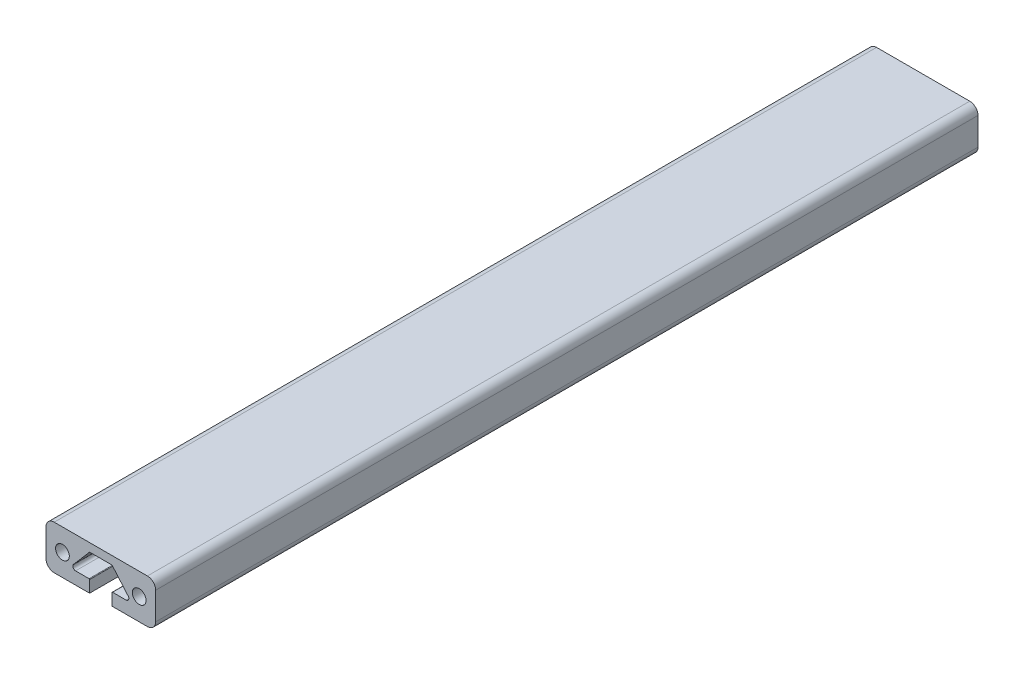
ISO-10303-21;
HEADER;
FILE_DESCRIPTION(('STEP AP214'),'2;1');
FILE_NAME('part.step','',(''),(''),'','','');
FILE_SCHEMA(('AUTOMOTIVE_DESIGN { 1 0 10303 214 1 1 1 1 }'));
ENDSEC;
DATA;
#1=APPLICATION_CONTEXT('core data for automotive mechanical design processes');
#2=APPLICATION_PROTOCOL_DEFINITION('international standard','automotive_design',2000,#1);
#3=PRODUCT_CONTEXT('',#1,'mechanical');
#4=PRODUCT('Part','Part','',(#3));
#5=PRODUCT_RELATED_PRODUCT_CATEGORY('part','',(#4));
#6=PRODUCT_DEFINITION_FORMATION('','',#4);
#7=PRODUCT_DEFINITION_CONTEXT('part definition',#1,'design');
#8=PRODUCT_DEFINITION('design','',#6,#7);
#9=PRODUCT_DEFINITION_SHAPE('','',#8);
#10=(LENGTH_UNIT() NAMED_UNIT(*) SI_UNIT(.MILLI.,.METRE.));
#11=(NAMED_UNIT(*) PLANE_ANGLE_UNIT() SI_UNIT($,.RADIAN.));
#12=(NAMED_UNIT(*) SI_UNIT($,.STERADIAN.) SOLID_ANGLE_UNIT());
#13=UNCERTAINTY_MEASURE_WITH_UNIT(LENGTH_MEASURE(1.E-05),#10,'distance_accuracy_value','');
#14=(GEOMETRIC_REPRESENTATION_CONTEXT(3) GLOBAL_UNCERTAINTY_ASSIGNED_CONTEXT((#13)) GLOBAL_UNIT_ASSIGNED_CONTEXT((#10,
#11,#12)) REPRESENTATION_CONTEXT('',''));
#15=CARTESIAN_POINT('',(0.,0.,0.));
#16=DIRECTION('',(0.,0.,1.));
#17=DIRECTION('',(1.,0.,0.));
#18=AXIS2_PLACEMENT_3D('',#15,#16,#17);
#19=CARTESIAN_POINT('',(-17.,-5.,150.));
#20=DIRECTION('',(0.,0.,1.));
#21=DIRECTION('',(1.,0.,0.));
#22=AXIS2_PLACEMENT_3D('',#19,#20,#21);
#23=PLANE('',#22);
#24=CARTESIAN_POINT('',(-14.,0.,150.));
#25=DIRECTION('',(0.,0.,1.));
#26=DIRECTION('',(1.,0.,0.));
#27=AXIS2_PLACEMENT_3D('',#24,#25,#26);
#28=CIRCLE('',#27,2.5);
#29=CARTESIAN_POINT('',(-11.5,0.,150.));
#30=VERTEX_POINT('',#29);
#31=EDGE_CURVE('E219',#30,#30,#28,.T.);
#32=ORIENTED_EDGE('',*,*,#31,.F.);
#33=EDGE_LOOP('',(#32));
#34=FACE_BOUND('',#33,.T.);
#35=CARTESIAN_POINT('',(-17.,-5.,150.));
#36=DIRECTION('',(0.,0.,1.));
#37=DIRECTION('',(1.,0.,0.));
#38=AXIS2_PLACEMENT_3D('',#35,#36,#37);
#39=CIRCLE('',#38,3.);
#40=CARTESIAN_POINT('',(-20.,-5.,150.));
#41=VERTEX_POINT('',#40);
#42=CARTESIAN_POINT('',(-17.,-8.,150.));
#43=VERTEX_POINT('',#42);
#44=EDGE_CURVE('E274',#41,#43,#39,.T.);
#45=ORIENTED_EDGE('',*,*,#44,.T.);
#46=DIRECTION('',(1.,0.,0.));
#47=VECTOR('',#46,1.);
#48=CARTESIAN_POINT('',(-17.,-8.,150.));
#49=LINE('',#48,#47);
#50=CARTESIAN_POINT('',(-4.098545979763,-8.,150.));
#51=VERTEX_POINT('',#50);
#52=EDGE_CURVE('E136',#43,#51,#49,.T.);
#53=ORIENTED_EDGE('',*,*,#52,.T.);
#54=DIRECTION('',(0.,1.,0.));
#55=VECTOR('',#54,1.);
#56=CARTESIAN_POINT('',(-4.098545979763,-8.,150.));
#57=LINE('',#56,#55);
#58=CARTESIAN_POINT('',(-4.098545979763,-3.70000000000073,150.));
#59=VERTEX_POINT('',#58);
#60=EDGE_CURVE('E342',#51,#59,#57,.T.);
#61=ORIENTED_EDGE('',*,*,#60,.T.);
#62=CARTESIAN_POINT('',(-4.29854597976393,-3.70000000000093,150.));
#63=DIRECTION('',(0.,0.,1.));
#64=DIRECTION('',(1.,0.,0.));
#65=AXIS2_PLACEMENT_3D('',#62,#63,#64);
#66=CIRCLE('',#65,0.200000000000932);
#67=CARTESIAN_POINT('',(-4.29854597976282,-3.5,150.));
#68=VERTEX_POINT('',#67);
#69=EDGE_CURVE('E362',#59,#68,#66,.T.);
#70=ORIENTED_EDGE('',*,*,#69,.T.);
#71=DIRECTION('',(-1.,0.,0.));
#72=VECTOR('',#71,1.);
#73=CARTESIAN_POINT('',(-4.29854597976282,-3.5,150.));
#74=LINE('',#73,#72);
#75=CARTESIAN_POINT('',(-9.21858593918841,-3.5,150.));
#76=VERTEX_POINT('',#75);
#77=EDGE_CURVE('E358',#68,#76,#74,.T.);
#78=ORIENTED_EDGE('',*,*,#77,.T.);
#79=CARTESIAN_POINT('',(-9.21858593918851,-2.50000000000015,150.));
#80=DIRECTION('',(0.,0.,-1.));
#81=DIRECTION('',(1.,0.,0.));
#82=AXIS2_PLACEMENT_3D('',#79,#80,#81);
#83=CIRCLE('',#82,0.999999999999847);
#84=CARTESIAN_POINT('',(-9.97737449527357,-1.84866296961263,150.));
#85=VERTEX_POINT('',#84);
#86=EDGE_CURVE('E361',#76,#85,#83,.T.);
#87=ORIENTED_EDGE('',*,*,#86,.T.);
#88=DIRECTION('',(0.651337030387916,0.758788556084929,0.));
#89=VECTOR('',#88,1.);
#90=CARTESIAN_POINT('',(-9.97737449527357,-1.84866296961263,150.));
#91=LINE('',#90,#89);
#92=CARTESIAN_POINT('',(-4.098545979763,5.,150.));
#93=VERTEX_POINT('',#92);
#94=EDGE_CURVE('E366',#85,#93,#91,.T.);
#95=ORIENTED_EDGE('',*,*,#94,.T.);
#96=DIRECTION('',(1.,0.,0.));
#97=VECTOR('',#96,1.);
#98=CARTESIAN_POINT('',(-4.098545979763,5.,150.));
#99=LINE('',#98,#97);
#100=CARTESIAN_POINT('',(4.09854597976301,5.,150.));
#101=VERTEX_POINT('',#100);
#102=EDGE_CURVE('E374',#93,#101,#99,.T.);
#103=ORIENTED_EDGE('',*,*,#102,.T.);
#104=DIRECTION('',(0.651337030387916,-0.758788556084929,0.));
#105=VECTOR('',#104,1.);
#106=CARTESIAN_POINT('',(4.09854597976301,5.,150.));
#107=LINE('',#106,#105);
#108=CARTESIAN_POINT('',(9.97737449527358,-1.84866296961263,150.));
#109=VERTEX_POINT('',#108);
#110=EDGE_CURVE('E377',#101,#109,#107,.T.);
#111=ORIENTED_EDGE('',*,*,#110,.T.);
#112=CARTESIAN_POINT('',(9.21858593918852,-2.50000000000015,150.));
#113=DIRECTION('',(0.,0.,-1.));
#114=DIRECTION('',(1.,0.,0.));
#115=AXIS2_PLACEMENT_3D('',#112,#113,#114);
#116=CIRCLE('',#115,0.999999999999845);
#117=CARTESIAN_POINT('',(9.21858593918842,-3.5,150.));
#118=VERTEX_POINT('',#117);
#119=EDGE_CURVE('E380',#109,#118,#116,.T.);
#120=ORIENTED_EDGE('',*,*,#119,.T.);
#121=DIRECTION('',(-1.,0.,0.));
#122=VECTOR('',#121,1.);
#123=CARTESIAN_POINT('',(9.21858593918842,-3.5,150.));
#124=LINE('',#123,#122);
#125=CARTESIAN_POINT('',(4.29854597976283,-3.5,150.));
#126=VERTEX_POINT('',#125);
#127=EDGE_CURVE('E383',#118,#126,#124,.T.);
#128=ORIENTED_EDGE('',*,*,#127,.T.);
#129=CARTESIAN_POINT('',(4.29854597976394,-3.70000000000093,150.));
#130=DIRECTION('',(0.,0.,1.));
#131=DIRECTION('',(1.,0.,0.));
#132=AXIS2_PLACEMENT_3D('',#129,#130,#131);
#133=CIRCLE('',#132,0.200000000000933);
#134=CARTESIAN_POINT('',(4.09854597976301,-3.70000000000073,150.));
#135=VERTEX_POINT('',#134);
#136=EDGE_CURVE('E386',#126,#135,#133,.T.);
#137=ORIENTED_EDGE('',*,*,#136,.T.);
#138=DIRECTION('',(0.,-1.,0.));
#139=VECTOR('',#138,1.);
#140=CARTESIAN_POINT('',(4.09854597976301,-3.70000000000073,150.));
#141=LINE('',#140,#139);
#142=CARTESIAN_POINT('',(4.09854597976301,-8.,150.));
#143=VERTEX_POINT('',#142);
#144=EDGE_CURVE('E389',#135,#143,#141,.T.);
#145=ORIENTED_EDGE('',*,*,#144,.T.);
#146=DIRECTION('',(1.,0.,0.));
#147=VECTOR('',#146,1.);
#148=CARTESIAN_POINT('',(4.09854597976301,-8.,150.));
#149=LINE('',#148,#147);
#150=CARTESIAN_POINT('',(17.,-8.,150.));
#151=VERTEX_POINT('',#150);
#152=EDGE_CURVE('E392',#143,#151,#149,.T.);
#153=ORIENTED_EDGE('',*,*,#152,.T.);
#154=CARTESIAN_POINT('',(17.,-5.00000000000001,150.));
#155=DIRECTION('',(0.,0.,1.));
#156=DIRECTION('',(1.,0.,0.));
#157=AXIS2_PLACEMENT_3D('',#154,#155,#156);
#158=CIRCLE('',#157,2.99999999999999);
#159=CARTESIAN_POINT('',(20.,-5.,150.));
#160=VERTEX_POINT('',#159);
#161=EDGE_CURVE('E394',#151,#160,#158,.T.);
#162=ORIENTED_EDGE('',*,*,#161,.T.);
#163=DIRECTION('',(0.,1.,0.));
#164=VECTOR('',#163,1.);
#165=CARTESIAN_POINT('',(20.,-5.,150.));
#166=LINE('',#165,#164);
#167=CARTESIAN_POINT('',(20.,5.,150.));
#168=VERTEX_POINT('',#167);
#169=EDGE_CURVE('E397',#160,#168,#166,.T.);
#170=ORIENTED_EDGE('',*,*,#169,.T.);
#171=CARTESIAN_POINT('',(17.,5.,150.));
#172=DIRECTION('',(0.,0.,1.));
#173=DIRECTION('',(1.,0.,0.));
#174=AXIS2_PLACEMENT_3D('',#171,#172,#173);
#175=CIRCLE('',#174,3.);
#176=CARTESIAN_POINT('',(17.,8.,150.));
#177=VERTEX_POINT('',#176);
#178=EDGE_CURVE('E191',#168,#177,#175,.T.);
#179=ORIENTED_EDGE('',*,*,#178,.T.);
#180=DIRECTION('',(-1.,0.,0.));
#181=VECTOR('',#180,1.);
#182=CARTESIAN_POINT('',(17.,8.,150.));
#183=LINE('',#182,#181);
#184=CARTESIAN_POINT('',(-17.,8.,150.));
#185=VERTEX_POINT('',#184);
#186=EDGE_CURVE('E185',#177,#185,#183,.T.);
#187=ORIENTED_EDGE('',*,*,#186,.T.);
#188=CARTESIAN_POINT('',(-17.,5.,150.));
#189=DIRECTION('',(0.,0.,1.));
#190=DIRECTION('',(1.,0.,0.));
#191=AXIS2_PLACEMENT_3D('',#188,#189,#190);
#192=CIRCLE('',#191,3.);
#193=CARTESIAN_POINT('',(-20.,5.,150.));
#194=VERTEX_POINT('',#193);
#195=EDGE_CURVE('E189',#185,#194,#192,.T.);
#196=ORIENTED_EDGE('',*,*,#195,.T.);
#197=DIRECTION('',(0.,-1.,0.));
#198=VECTOR('',#197,1.);
#199=CARTESIAN_POINT('',(-20.,5.,150.));
#200=LINE('',#199,#198);
#201=EDGE_CURVE('E57',#194,#41,#200,.T.);
#202=ORIENTED_EDGE('',*,*,#201,.T.);
#203=EDGE_LOOP('',(#45,#53,#61,#70,#78,#87,#95,#103,#111,#120,#128,#137,#145,#153,#162,#170,
#179,#187,#196,#202));
#204=FACE_BOUND('',#203,.T.);
#205=CARTESIAN_POINT('',(14.,0.,150.));
#206=DIRECTION('',(0.,0.,1.));
#207=DIRECTION('',(1.,0.,0.));
#208=AXIS2_PLACEMENT_3D('',#205,#206,#207);
#209=CIRCLE('',#208,2.5);
#210=CARTESIAN_POINT('',(16.5,0.,150.));
#211=VERTEX_POINT('',#210);
#212=EDGE_CURVE('E408',#211,#211,#209,.T.);
#213=ORIENTED_EDGE('',*,*,#212,.F.);
#214=EDGE_LOOP('',(#213));
#215=FACE_BOUND('',#214,.T.);
#216=ADVANCED_FACE('F39',(#34,#204,#215),#23,.T.);
#217=CARTESIAN_POINT('',(-17.,-5.,-150.));
#218=DIRECTION('',(0.,0.,1.));
#219=DIRECTION('',(1.,0.,0.));
#220=AXIS2_PLACEMENT_3D('',#217,#218,#219);
#221=PLANE('',#220);
#222=CARTESIAN_POINT('',(-14.,0.,-150.));
#223=DIRECTION('',(0.,0.,1.));
#224=DIRECTION('',(1.,0.,0.));
#225=AXIS2_PLACEMENT_3D('',#222,#223,#224);
#226=CIRCLE('',#225,2.5);
#227=CARTESIAN_POINT('',(-11.5,0.,-150.));
#228=VERTEX_POINT('',#227);
#229=EDGE_CURVE('E402',#228,#228,#226,.T.);
#230=ORIENTED_EDGE('',*,*,#229,.T.);
#231=EDGE_LOOP('',(#230));
#232=FACE_BOUND('',#231,.T.);
#233=CARTESIAN_POINT('',(-17.,-5.,-150.));
#234=DIRECTION('',(0.,0.,1.));
#235=DIRECTION('',(1.,0.,0.));
#236=AXIS2_PLACEMENT_3D('',#233,#234,#235);
#237=CIRCLE('',#236,3.);
#238=CARTESIAN_POINT('',(-20.,-5.,-150.));
#239=VERTEX_POINT('',#238);
#240=CARTESIAN_POINT('',(-17.,-8.,-150.));
#241=VERTEX_POINT('',#240);
#242=EDGE_CURVE('E214',#239,#241,#237,.T.);
#243=ORIENTED_EDGE('',*,*,#242,.F.);
#244=DIRECTION('',(0.,-1.,0.));
#245=VECTOR('',#244,1.);
#246=CARTESIAN_POINT('',(-20.,5.,-150.));
#247=LINE('',#246,#245);
#248=CARTESIAN_POINT('',(-20.,5.,-150.));
#249=VERTEX_POINT('',#248);
#250=EDGE_CURVE('E128',#249,#239,#247,.T.);
#251=ORIENTED_EDGE('',*,*,#250,.F.);
#252=CARTESIAN_POINT('',(-17.,5.,-150.));
#253=DIRECTION('',(0.,0.,1.));
#254=DIRECTION('',(1.,0.,0.));
#255=AXIS2_PLACEMENT_3D('',#252,#253,#254);
#256=CIRCLE('',#255,3.);
#257=CARTESIAN_POINT('',(-17.,8.,-150.));
#258=VERTEX_POINT('',#257);
#259=EDGE_CURVE('E122',#258,#249,#256,.T.);
#260=ORIENTED_EDGE('',*,*,#259,.F.);
#261=DIRECTION('',(-1.,0.,0.));
#262=VECTOR('',#261,1.);
#263=CARTESIAN_POINT('',(0.,8.,-150.));
#264=LINE('',#263,#262);
#265=CARTESIAN_POINT('',(17.,8.,-150.));
#266=VERTEX_POINT('',#265);
#267=EDGE_CURVE('E199',#266,#258,#264,.T.);
#268=ORIENTED_EDGE('',*,*,#267,.F.);
#269=CARTESIAN_POINT('',(17.,5.,-150.));
#270=DIRECTION('',(0.,0.,1.));
#271=DIRECTION('',(1.,0.,0.));
#272=AXIS2_PLACEMENT_3D('',#269,#270,#271);
#273=CIRCLE('',#272,3.);
#274=CARTESIAN_POINT('',(20.,5.,-150.));
#275=VERTEX_POINT('',#274);
#276=EDGE_CURVE('E264',#275,#266,#273,.T.);
#277=ORIENTED_EDGE('',*,*,#276,.F.);
#278=DIRECTION('',(0.,1.,0.));
#279=VECTOR('',#278,1.);
#280=CARTESIAN_POINT('',(20.,-5.,-150.));
#281=LINE('',#280,#279);
#282=CARTESIAN_POINT('',(20.,-5.,-150.));
#283=VERTEX_POINT('',#282);
#284=EDGE_CURVE('E261',#283,#275,#281,.T.);
#285=ORIENTED_EDGE('',*,*,#284,.F.);
#286=CARTESIAN_POINT('',(17.,-5.00000000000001,-150.));
#287=DIRECTION('',(0.,0.,1.));
#288=DIRECTION('',(1.,0.,0.));
#289=AXIS2_PLACEMENT_3D('',#286,#287,#288);
#290=CIRCLE('',#289,2.99999999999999);
#291=CARTESIAN_POINT('',(17.,-8.,-150.));
#292=VERTEX_POINT('',#291);
#293=EDGE_CURVE('E258',#292,#283,#290,.T.);
#294=ORIENTED_EDGE('',*,*,#293,.F.);
#295=DIRECTION('',(1.,0.,0.));
#296=VECTOR('',#295,1.);
#297=CARTESIAN_POINT('',(4.09854597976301,-8.,-150.));
#298=LINE('',#297,#296);
#299=CARTESIAN_POINT('',(4.09854597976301,-8.,-150.));
#300=VERTEX_POINT('',#299);
#301=EDGE_CURVE('E255',#300,#292,#298,.T.);
#302=ORIENTED_EDGE('',*,*,#301,.F.);
#303=DIRECTION('',(0.,-1.,0.));
#304=VECTOR('',#303,1.);
#305=CARTESIAN_POINT('',(4.09854597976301,-3.70000000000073,-150.));
#306=LINE('',#305,#304);
#307=CARTESIAN_POINT('',(4.09854597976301,-3.70000000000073,-150.));
#308=VERTEX_POINT('',#307);
#309=EDGE_CURVE('E253',#308,#300,#306,.T.);
#310=ORIENTED_EDGE('',*,*,#309,.F.);
#311=CARTESIAN_POINT('',(4.29854597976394,-3.70000000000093,-150.));
#312=DIRECTION('',(0.,0.,1.));
#313=DIRECTION('',(1.,0.,0.));
#314=AXIS2_PLACEMENT_3D('',#311,#312,#313);
#315=CIRCLE('',#314,0.200000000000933);
#316=CARTESIAN_POINT('',(4.29854597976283,-3.5,-150.));
#317=VERTEX_POINT('',#316);
#318=EDGE_CURVE('E250',#317,#308,#315,.T.);
#319=ORIENTED_EDGE('',*,*,#318,.F.);
#320=DIRECTION('',(-1.,0.,0.));
#321=VECTOR('',#320,1.);
#322=CARTESIAN_POINT('',(9.21858593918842,-3.5,-150.));
#323=LINE('',#322,#321);
#324=CARTESIAN_POINT('',(9.21858593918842,-3.5,-150.));
#325=VERTEX_POINT('',#324);
#326=EDGE_CURVE('E247',#325,#317,#323,.T.);
#327=ORIENTED_EDGE('',*,*,#326,.F.);
#328=CARTESIAN_POINT('',(9.21858593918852,-2.50000000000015,-150.));
#329=DIRECTION('',(0.,0.,-1.));
#330=DIRECTION('',(1.,0.,0.));
#331=AXIS2_PLACEMENT_3D('',#328,#329,#330);
#332=CIRCLE('',#331,0.999999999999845);
#333=CARTESIAN_POINT('',(9.97737449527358,-1.84866296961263,-150.));
#334=VERTEX_POINT('',#333);
#335=EDGE_CURVE('E244',#334,#325,#332,.T.);
#336=ORIENTED_EDGE('',*,*,#335,.F.);
#337=DIRECTION('',(0.651337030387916,-0.758788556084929,0.));
#338=VECTOR('',#337,1.);
#339=CARTESIAN_POINT('',(4.09854597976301,5.,-150.));
#340=LINE('',#339,#338);
#341=CARTESIAN_POINT('',(4.09854597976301,5.,-150.));
#342=VERTEX_POINT('',#341);
#343=EDGE_CURVE('E241',#342,#334,#340,.T.);
#344=ORIENTED_EDGE('',*,*,#343,.F.);
#345=DIRECTION('',(1.,0.,0.));
#346=VECTOR('',#345,1.);
#347=CARTESIAN_POINT('',(0.,5.,-150.));
#348=LINE('',#347,#346);
#349=CARTESIAN_POINT('',(-4.098545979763,5.,-150.));
#350=VERTEX_POINT('',#349);
#351=EDGE_CURVE('E238',#350,#342,#348,.T.);
#352=ORIENTED_EDGE('',*,*,#351,.F.);
#353=DIRECTION('',(0.651337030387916,0.758788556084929,0.));
#354=VECTOR('',#353,1.);
#355=CARTESIAN_POINT('',(-9.97737449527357,-1.84866296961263,-150.));
#356=LINE('',#355,#354);
#357=CARTESIAN_POINT('',(-9.97737449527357,-1.84866296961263,-150.));
#358=VERTEX_POINT('',#357);
#359=EDGE_CURVE('E234',#358,#350,#356,.T.);
#360=ORIENTED_EDGE('',*,*,#359,.F.);
#361=CARTESIAN_POINT('',(-9.21858593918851,-2.50000000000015,-150.));
#362=DIRECTION('',(0.,0.,-1.));
#363=DIRECTION('',(1.,0.,0.));
#364=AXIS2_PLACEMENT_3D('',#361,#362,#363);
#365=CIRCLE('',#364,0.999999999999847);
#366=CARTESIAN_POINT('',(-9.21858593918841,-3.5,-150.));
#367=VERTEX_POINT('',#366);
#368=EDGE_CURVE('E231',#367,#358,#365,.T.);
#369=ORIENTED_EDGE('',*,*,#368,.F.);
#370=DIRECTION('',(-1.,0.,0.));
#371=VECTOR('',#370,1.);
#372=CARTESIAN_POINT('',(-4.29854597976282,-3.5,-150.));
#373=LINE('',#372,#371);
#374=CARTESIAN_POINT('',(-4.29854597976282,-3.5,-150.));
#375=VERTEX_POINT('',#374);
#376=EDGE_CURVE('E228',#375,#367,#373,.T.);
#377=ORIENTED_EDGE('',*,*,#376,.F.);
#378=CARTESIAN_POINT('',(-4.29854597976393,-3.70000000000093,-150.));
#379=DIRECTION('',(0.,0.,1.));
#380=DIRECTION('',(1.,0.,0.));
#381=AXIS2_PLACEMENT_3D('',#378,#379,#380);
#382=CIRCLE('',#381,0.200000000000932);
#383=CARTESIAN_POINT('',(-4.098545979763,-3.70000000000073,-150.));
#384=VERTEX_POINT('',#383);
#385=EDGE_CURVE('E225',#384,#375,#382,.T.);
#386=ORIENTED_EDGE('',*,*,#385,.F.);
#387=DIRECTION('',(0.,1.,0.));
#388=VECTOR('',#387,1.);
#389=CARTESIAN_POINT('',(-4.098545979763,-8.,-150.));
#390=LINE('',#389,#388);
#391=CARTESIAN_POINT('',(-4.098545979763,-8.,-150.));
#392=VERTEX_POINT('',#391);
#393=EDGE_CURVE('E222',#392,#384,#390,.T.);
#394=ORIENTED_EDGE('',*,*,#393,.F.);
#395=DIRECTION('',(1.,0.,0.));
#396=VECTOR('',#395,1.);
#397=CARTESIAN_POINT('',(-17.,-8.,-150.));
#398=LINE('',#397,#396);
#399=EDGE_CURVE('E218',#241,#392,#398,.T.);
#400=ORIENTED_EDGE('',*,*,#399,.F.);
#401=EDGE_LOOP('',(#243,#251,#260,#268,#277,#285,#294,#302,#310,#319,#327,#336,#344,#352,#360,
#369,#377,#386,#394,#400));
#402=FACE_BOUND('',#401,.T.);
#403=CARTESIAN_POINT('',(14.,0.,-150.));
#404=DIRECTION('',(0.,0.,1.));
#405=DIRECTION('',(1.,0.,0.));
#406=AXIS2_PLACEMENT_3D('',#403,#404,#405);
#407=CIRCLE('',#406,2.5);
#408=CARTESIAN_POINT('',(16.5,0.,-150.));
#409=VERTEX_POINT('',#408);
#410=EDGE_CURVE('E411',#409,#409,#407,.T.);
#411=ORIENTED_EDGE('',*,*,#410,.T.);
#412=EDGE_LOOP('',(#411));
#413=FACE_BOUND('',#412,.T.);
#414=ADVANCED_FACE('F346',(#232,#402,#413),#221,.F.);
#415=CARTESIAN_POINT('',(-17.,-5.,150.));
#416=DIRECTION('',(0.,0.,-1.));
#417=DIRECTION('',(-1.,0.,0.));
#418=AXIS2_PLACEMENT_3D('',#415,#416,#417);
#419=CYLINDRICAL_SURFACE('',#418,3.);
#420=ORIENTED_EDGE('',*,*,#242,.T.);
#421=DIRECTION('',(0.,0.,-1.));
#422=VECTOR('',#421,1.);
#423=CARTESIAN_POINT('',(-17.,-8.,150.));
#424=LINE('',#423,#422);
#425=EDGE_CURVE('E11',#43,#241,#424,.T.);
#426=ORIENTED_EDGE('',*,*,#425,.F.);
#427=ORIENTED_EDGE('',*,*,#44,.F.);
#428=DIRECTION('',(0.,0.,-1.));
#429=VECTOR('',#428,1.);
#430=CARTESIAN_POINT('',(-20.,-5.,150.));
#431=LINE('',#430,#429);
#432=EDGE_CURVE('E210',#41,#239,#431,.T.);
#433=ORIENTED_EDGE('',*,*,#432,.T.);
#434=EDGE_LOOP('',(#420,#426,#427,#433));
#435=FACE_BOUND('',#434,.T.);
#436=ADVANCED_FACE('F41',(#435),#419,.T.);
#437=CARTESIAN_POINT('',(-17.,-8.,150.));
#438=DIRECTION('',(0.,1.,0.));
#439=DIRECTION('',(0.,0.,1.));
#440=AXIS2_PLACEMENT_3D('',#437,#438,#439);
#441=PLANE('',#440);
#442=ORIENTED_EDGE('',*,*,#399,.T.);
#443=DIRECTION('',(0.,0.,-1.));
#444=VECTOR('',#443,1.);
#445=CARTESIAN_POINT('',(-4.098545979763,-8.,150.));
#446=LINE('',#445,#444);
#447=EDGE_CURVE('E49',#51,#392,#446,.T.);
#448=ORIENTED_EDGE('',*,*,#447,.F.);
#449=ORIENTED_EDGE('',*,*,#52,.F.);
#450=ORIENTED_EDGE('',*,*,#425,.T.);
#451=EDGE_LOOP('',(#442,#448,#449,#450));
#452=FACE_BOUND('',#451,.T.);
#453=ADVANCED_FACE('F421',(#452),#441,.F.);
#454=CARTESIAN_POINT('',(-4.098545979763,-8.,150.));
#455=DIRECTION('',(-1.,0.,0.));
#456=DIRECTION('',(0.,0.,1.));
#457=AXIS2_PLACEMENT_3D('',#454,#455,#456);
#458=PLANE('',#457);
#459=ORIENTED_EDGE('',*,*,#393,.T.);
#460=DIRECTION('',(0.,0.,-1.));
#461=VECTOR('',#460,1.);
#462=CARTESIAN_POINT('',(-4.098545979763,-3.70000000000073,150.));
#463=LINE('',#462,#461);
#464=EDGE_CURVE('E332',#59,#384,#463,.T.);
#465=ORIENTED_EDGE('',*,*,#464,.F.);
#466=ORIENTED_EDGE('',*,*,#60,.F.);
#467=ORIENTED_EDGE('',*,*,#447,.T.);
#468=EDGE_LOOP('',(#459,#465,#466,#467));
#469=FACE_BOUND('',#468,.T.);
#470=ADVANCED_FACE('F340',(#469),#458,.F.);
#471=CARTESIAN_POINT('',(-4.29854597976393,-3.70000000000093,150.));
#472=DIRECTION('',(0.,0.,-1.));
#473=DIRECTION('',(-1.,0.,0.));
#474=AXIS2_PLACEMENT_3D('',#471,#472,#473);
#475=CYLINDRICAL_SURFACE('',#474,0.200000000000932);
#476=ORIENTED_EDGE('',*,*,#385,.T.);
#477=DIRECTION('',(0.,0.,-1.));
#478=VECTOR('',#477,1.);
#479=CARTESIAN_POINT('',(-4.29854597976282,-3.5,150.));
#480=LINE('',#479,#478);
#481=EDGE_CURVE('E329',#68,#375,#480,.T.);
#482=ORIENTED_EDGE('',*,*,#481,.F.);
#483=ORIENTED_EDGE('',*,*,#69,.F.);
#484=ORIENTED_EDGE('',*,*,#464,.T.);
#485=EDGE_LOOP('',(#476,#482,#483,#484));
#486=FACE_BOUND('',#485,.T.);
#487=ADVANCED_FACE('F352',(#486),#475,.T.);
#488=CARTESIAN_POINT('',(-4.29854597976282,-3.5,150.));
#489=DIRECTION('',(0.,-1.,0.));
#490=DIRECTION('',(1.,0.,0.));
#491=AXIS2_PLACEMENT_3D('',#488,#489,#490);
#492=PLANE('',#491);
#493=ORIENTED_EDGE('',*,*,#376,.T.);
#494=DIRECTION('',(0.,0.,-1.));
#495=VECTOR('',#494,1.);
#496=CARTESIAN_POINT('',(-9.21858593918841,-3.5,150.));
#497=LINE('',#496,#495);
#498=EDGE_CURVE('E325',#76,#367,#497,.T.);
#499=ORIENTED_EDGE('',*,*,#498,.F.);
#500=ORIENTED_EDGE('',*,*,#77,.F.);
#501=ORIENTED_EDGE('',*,*,#481,.T.);
#502=EDGE_LOOP('',(#493,#499,#500,#501));
#503=FACE_BOUND('',#502,.T.);
#504=ADVANCED_FACE('F356',(#503),#492,.F.);
#505=CARTESIAN_POINT('',(-9.21858593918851,-2.50000000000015,150.));
#506=DIRECTION('',(0.,0.,-1.));
#507=DIRECTION('',(-1.,0.,0.));
#508=AXIS2_PLACEMENT_3D('',#505,#506,#507);
#509=CYLINDRICAL_SURFACE('',#508,0.999999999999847);
#510=ORIENTED_EDGE('',*,*,#368,.T.);
#511=DIRECTION('',(0.,0.,-1.));
#512=VECTOR('',#511,1.);
#513=CARTESIAN_POINT('',(-9.97737449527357,-1.84866296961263,150.));
#514=LINE('',#513,#512);
#515=EDGE_CURVE('E321',#85,#358,#514,.T.);
#516=ORIENTED_EDGE('',*,*,#515,.F.);
#517=ORIENTED_EDGE('',*,*,#86,.F.);
#518=ORIENTED_EDGE('',*,*,#498,.T.);
#519=EDGE_LOOP('',(#510,#516,#517,#518));
#520=FACE_BOUND('',#519,.T.);
#521=ADVANCED_FACE('F490',(#520),#509,.F.);
#522=CARTESIAN_POINT('',(-9.97737449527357,-1.84866296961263,150.));
#523=DIRECTION('',(-0.758788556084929,0.651337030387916,0.));
#524=DIRECTION('',(-0.651337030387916,-0.758788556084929,0.));
#525=AXIS2_PLACEMENT_3D('',#522,#523,#524);
#526=PLANE('',#525);
#527=ORIENTED_EDGE('',*,*,#359,.T.);
#528=DIRECTION('',(0.,0.,-1.));
#529=VECTOR('',#528,1.);
#530=CARTESIAN_POINT('',(-4.098545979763,5.,150.));
#531=LINE('',#530,#529);
#532=EDGE_CURVE('E317',#93,#350,#531,.T.);
#533=ORIENTED_EDGE('',*,*,#532,.F.);
#534=ORIENTED_EDGE('',*,*,#94,.F.);
#535=ORIENTED_EDGE('',*,*,#515,.T.);
#536=EDGE_LOOP('',(#527,#533,#534,#535));
#537=FACE_BOUND('',#536,.T.);
#538=ADVANCED_FACE('F486',(#537),#526,.F.);
#539=CARTESIAN_POINT('',(0.,5.,150.));
#540=DIRECTION('',(0.,1.,0.));
#541=DIRECTION('',(0.,0.,1.));
#542=AXIS2_PLACEMENT_3D('',#539,#540,#541);
#543=PLANE('',#542);
#544=ORIENTED_EDGE('',*,*,#351,.T.);
#545=DIRECTION('',(0.,0.,-1.));
#546=VECTOR('',#545,1.);
#547=CARTESIAN_POINT('',(4.09854597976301,5.,150.));
#548=LINE('',#547,#546);
#549=EDGE_CURVE('E313',#101,#342,#548,.T.);
#550=ORIENTED_EDGE('',*,*,#549,.F.);
#551=ORIENTED_EDGE('',*,*,#102,.F.);
#552=ORIENTED_EDGE('',*,*,#532,.T.);
#553=EDGE_LOOP('',(#544,#550,#551,#552));
#554=FACE_BOUND('',#553,.T.);
#555=ADVANCED_FACE('F482',(#554),#543,.F.);
#556=CARTESIAN_POINT('',(4.09854597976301,5.,150.));
#557=DIRECTION('',(0.758788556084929,0.651337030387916,0.));
#558=DIRECTION('',(-0.651337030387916,0.758788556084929,0.));
#559=AXIS2_PLACEMENT_3D('',#556,#557,#558);
#560=PLANE('',#559);
#561=ORIENTED_EDGE('',*,*,#343,.T.);
#562=DIRECTION('',(0.,0.,-1.));
#563=VECTOR('',#562,1.);
#564=CARTESIAN_POINT('',(9.97737449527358,-1.84866296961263,150.));
#565=LINE('',#564,#563);
#566=EDGE_CURVE('E309',#109,#334,#565,.T.);
#567=ORIENTED_EDGE('',*,*,#566,.F.);
#568=ORIENTED_EDGE('',*,*,#110,.F.);
#569=ORIENTED_EDGE('',*,*,#549,.T.);
#570=EDGE_LOOP('',(#561,#567,#568,#569));
#571=FACE_BOUND('',#570,.T.);
#572=ADVANCED_FACE('F478',(#571),#560,.F.);
#573=CARTESIAN_POINT('',(9.21858593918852,-2.50000000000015,150.));
#574=DIRECTION('',(0.,0.,-1.));
#575=DIRECTION('',(-1.,0.,0.));
#576=AXIS2_PLACEMENT_3D('',#573,#574,#575);
#577=CYLINDRICAL_SURFACE('',#576,0.999999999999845);
#578=ORIENTED_EDGE('',*,*,#335,.T.);
#579=DIRECTION('',(0.,0.,-1.));
#580=VECTOR('',#579,1.);
#581=CARTESIAN_POINT('',(9.21858593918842,-3.5,150.));
#582=LINE('',#581,#580);
#583=EDGE_CURVE('E305',#118,#325,#582,.T.);
#584=ORIENTED_EDGE('',*,*,#583,.F.);
#585=ORIENTED_EDGE('',*,*,#119,.F.);
#586=ORIENTED_EDGE('',*,*,#566,.T.);
#587=EDGE_LOOP('',(#578,#584,#585,#586));
#588=FACE_BOUND('',#587,.T.);
#589=ADVANCED_FACE('F474',(#588),#577,.F.);
#590=CARTESIAN_POINT('',(9.21858593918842,-3.5,150.));
#591=DIRECTION('',(0.,-1.,0.));
#592=DIRECTION('',(0.,0.,-1.));
#593=AXIS2_PLACEMENT_3D('',#590,#591,#592);
#594=PLANE('',#593);
#595=ORIENTED_EDGE('',*,*,#326,.T.);
#596=DIRECTION('',(0.,0.,-1.));
#597=VECTOR('',#596,1.);
#598=CARTESIAN_POINT('',(4.29854597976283,-3.5,150.));
#599=LINE('',#598,#597);
#600=EDGE_CURVE('E301',#126,#317,#599,.T.);
#601=ORIENTED_EDGE('',*,*,#600,.F.);
#602=ORIENTED_EDGE('',*,*,#127,.F.);
#603=ORIENTED_EDGE('',*,*,#583,.T.);
#604=EDGE_LOOP('',(#595,#601,#602,#603));
#605=FACE_BOUND('',#604,.T.);
#606=ADVANCED_FACE('F470',(#605),#594,.F.);
#607=CARTESIAN_POINT('',(4.29854597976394,-3.70000000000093,150.));
#608=DIRECTION('',(0.,0.,-1.));
#609=DIRECTION('',(-1.,0.,0.));
#610=AXIS2_PLACEMENT_3D('',#607,#608,#609);
#611=CYLINDRICAL_SURFACE('',#610,0.200000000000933);
#612=ORIENTED_EDGE('',*,*,#318,.T.);
#613=DIRECTION('',(0.,0.,-1.));
#614=VECTOR('',#613,1.);
#615=CARTESIAN_POINT('',(4.09854597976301,-3.70000000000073,150.));
#616=LINE('',#615,#614);
#617=EDGE_CURVE('E297',#135,#308,#616,.T.);
#618=ORIENTED_EDGE('',*,*,#617,.F.);
#619=ORIENTED_EDGE('',*,*,#136,.F.);
#620=ORIENTED_EDGE('',*,*,#600,.T.);
#621=EDGE_LOOP('',(#612,#618,#619,#620));
#622=FACE_BOUND('',#621,.T.);
#623=ADVANCED_FACE('F466',(#622),#611,.T.);
#624=CARTESIAN_POINT('',(4.09854597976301,-3.70000000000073,150.));
#625=DIRECTION('',(1.,0.,0.));
#626=DIRECTION('',(0.,0.,-1.));
#627=AXIS2_PLACEMENT_3D('',#624,#625,#626);
#628=PLANE('',#627);
#629=ORIENTED_EDGE('',*,*,#309,.T.);
#630=DIRECTION('',(0.,0.,-1.));
#631=VECTOR('',#630,1.);
#632=CARTESIAN_POINT('',(4.09854597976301,-8.,150.));
#633=LINE('',#632,#631);
#634=EDGE_CURVE('E293',#143,#300,#633,.T.);
#635=ORIENTED_EDGE('',*,*,#634,.F.);
#636=ORIENTED_EDGE('',*,*,#144,.F.);
#637=ORIENTED_EDGE('',*,*,#617,.T.);
#638=EDGE_LOOP('',(#629,#635,#636,#637));
#639=FACE_BOUND('',#638,.T.);
#640=ADVANCED_FACE('F462',(#639),#628,.F.);
#641=CARTESIAN_POINT('',(4.09854597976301,-8.,150.));
#642=DIRECTION('',(0.,1.,0.));
#643=DIRECTION('',(0.,0.,1.));
#644=AXIS2_PLACEMENT_3D('',#641,#642,#643);
#645=PLANE('',#644);
#646=ORIENTED_EDGE('',*,*,#301,.T.);
#647=DIRECTION('',(0.,0.,-1.));
#648=VECTOR('',#647,1.);
#649=CARTESIAN_POINT('',(17.,-8.,150.));
#650=LINE('',#649,#648);
#651=EDGE_CURVE('E289',#151,#292,#650,.T.);
#652=ORIENTED_EDGE('',*,*,#651,.F.);
#653=ORIENTED_EDGE('',*,*,#152,.F.);
#654=ORIENTED_EDGE('',*,*,#634,.T.);
#655=EDGE_LOOP('',(#646,#652,#653,#654));
#656=FACE_BOUND('',#655,.T.);
#657=ADVANCED_FACE('F458',(#656),#645,.F.);
#658=CARTESIAN_POINT('',(17.,-5.00000000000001,150.));
#659=DIRECTION('',(0.,0.,-1.));
#660=DIRECTION('',(-1.,0.,0.));
#661=AXIS2_PLACEMENT_3D('',#658,#659,#660);
#662=CYLINDRICAL_SURFACE('',#661,2.99999999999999);
#663=ORIENTED_EDGE('',*,*,#293,.T.);
#664=DIRECTION('',(0.,0.,-1.));
#665=VECTOR('',#664,1.);
#666=CARTESIAN_POINT('',(20.,-5.,150.));
#667=LINE('',#666,#665);
#668=EDGE_CURVE('E285',#160,#283,#667,.T.);
#669=ORIENTED_EDGE('',*,*,#668,.F.);
#670=ORIENTED_EDGE('',*,*,#161,.F.);
#671=ORIENTED_EDGE('',*,*,#651,.T.);
#672=EDGE_LOOP('',(#663,#669,#670,#671));
#673=FACE_BOUND('',#672,.T.);
#674=ADVANCED_FACE('F454',(#673),#662,.T.);
#675=CARTESIAN_POINT('',(20.,-5.,150.));
#676=DIRECTION('',(-1.,0.,0.));
#677=DIRECTION('',(0.,0.,1.));
#678=AXIS2_PLACEMENT_3D('',#675,#676,#677);
#679=PLANE('',#678);
#680=ORIENTED_EDGE('',*,*,#284,.T.);
#681=DIRECTION('',(0.,0.,-1.));
#682=VECTOR('',#681,1.);
#683=CARTESIAN_POINT('',(20.,5.,150.));
#684=LINE('',#683,#682);
#685=EDGE_CURVE('E281',#168,#275,#684,.T.);
#686=ORIENTED_EDGE('',*,*,#685,.F.);
#687=ORIENTED_EDGE('',*,*,#169,.F.);
#688=ORIENTED_EDGE('',*,*,#668,.T.);
#689=EDGE_LOOP('',(#680,#686,#687,#688));
#690=FACE_BOUND('',#689,.T.);
#691=ADVANCED_FACE('F450',(#690),#679,.F.);
#692=CARTESIAN_POINT('',(17.,5.,150.));
#693=DIRECTION('',(0.,0.,-1.));
#694=DIRECTION('',(-1.,0.,0.));
#695=AXIS2_PLACEMENT_3D('',#692,#693,#694);
#696=CYLINDRICAL_SURFACE('',#695,3.);
#697=ORIENTED_EDGE('',*,*,#276,.T.);
#698=DIRECTION('',(0.,0.,-1.));
#699=VECTOR('',#698,1.);
#700=CARTESIAN_POINT('',(17.,8.,150.));
#701=LINE('',#700,#699);
#702=EDGE_CURVE('E201',#177,#266,#701,.T.);
#703=ORIENTED_EDGE('',*,*,#702,.F.);
#704=ORIENTED_EDGE('',*,*,#178,.F.);
#705=ORIENTED_EDGE('',*,*,#685,.T.);
#706=EDGE_LOOP('',(#697,#703,#704,#705));
#707=FACE_BOUND('',#706,.T.);
#708=ADVANCED_FACE('F447',(#707),#696,.T.);
#709=CARTESIAN_POINT('',(0.,8.,150.));
#710=DIRECTION('',(0.,-1.,0.));
#711=DIRECTION('',(0.,0.,-1.));
#712=AXIS2_PLACEMENT_3D('',#709,#710,#711);
#713=PLANE('',#712);
#714=ORIENTED_EDGE('',*,*,#267,.T.);
#715=DIRECTION('',(0.,0.,-1.));
#716=VECTOR('',#715,1.);
#717=CARTESIAN_POINT('',(-17.,8.,150.));
#718=LINE('',#717,#716);
#719=EDGE_CURVE('E197',#185,#258,#718,.T.);
#720=ORIENTED_EDGE('',*,*,#719,.F.);
#721=ORIENTED_EDGE('',*,*,#186,.F.);
#722=ORIENTED_EDGE('',*,*,#702,.T.);
#723=EDGE_LOOP('',(#714,#720,#721,#722));
#724=FACE_BOUND('',#723,.T.);
#725=ADVANCED_FACE('F198',(#724),#713,.F.);
#726=CARTESIAN_POINT('',(-17.,5.,150.));
#727=DIRECTION('',(0.,0.,-1.));
#728=DIRECTION('',(-1.,0.,0.));
#729=AXIS2_PLACEMENT_3D('',#726,#727,#728);
#730=CYLINDRICAL_SURFACE('',#729,3.);
#731=ORIENTED_EDGE('',*,*,#259,.T.);
#732=DIRECTION('',(0.,0.,-1.));
#733=VECTOR('',#732,1.);
#734=CARTESIAN_POINT('',(-20.,5.,150.));
#735=LINE('',#734,#733);
#736=EDGE_CURVE('E202',#194,#249,#735,.T.);
#737=ORIENTED_EDGE('',*,*,#736,.F.);
#738=ORIENTED_EDGE('',*,*,#195,.F.);
#739=ORIENTED_EDGE('',*,*,#719,.T.);
#740=EDGE_LOOP('',(#731,#737,#738,#739));
#741=FACE_BOUND('',#740,.T.);
#742=ADVANCED_FACE('F204',(#741),#730,.T.);
#743=CARTESIAN_POINT('',(-20.,5.,150.));
#744=DIRECTION('',(1.,0.,0.));
#745=DIRECTION('',(0.,0.,-1.));
#746=AXIS2_PLACEMENT_3D('',#743,#744,#745);
#747=PLANE('',#746);
#748=ORIENTED_EDGE('',*,*,#250,.T.);
#749=ORIENTED_EDGE('',*,*,#432,.F.);
#750=ORIENTED_EDGE('',*,*,#201,.F.);
#751=ORIENTED_EDGE('',*,*,#736,.T.);
#752=EDGE_LOOP('',(#748,#749,#750,#751));
#753=FACE_BOUND('',#752,.T.);
#754=ADVANCED_FACE('F440',(#753),#747,.F.);
#755=CARTESIAN_POINT('',(-14.,0.,150.));
#756=DIRECTION('',(0.,0.,-1.));
#757=DIRECTION('',(-1.,0.,0.));
#758=AXIS2_PLACEMENT_3D('',#755,#756,#757);
#759=CYLINDRICAL_SURFACE('',#758,2.5);
#760=ORIENTED_EDGE('',*,*,#31,.T.);
#761=EDGE_LOOP('',(#760));
#762=FACE_BOUND('',#761,.T.);
#763=ORIENTED_EDGE('',*,*,#229,.F.);
#764=EDGE_LOOP('',(#763));
#765=FACE_BOUND('',#764,.T.);
#766=ADVANCED_FACE('F437',(#762,#765),#759,.F.);
#767=CARTESIAN_POINT('',(14.,0.,150.));
#768=DIRECTION('',(0.,0.,-1.));
#769=DIRECTION('',(-1.,0.,0.));
#770=AXIS2_PLACEMENT_3D('',#767,#768,#769);
#771=CYLINDRICAL_SURFACE('',#770,2.5);
#772=ORIENTED_EDGE('',*,*,#212,.T.);
#773=EDGE_LOOP('',(#772));
#774=FACE_BOUND('',#773,.T.);
#775=ORIENTED_EDGE('',*,*,#410,.F.);
#776=EDGE_LOOP('',(#775));
#777=FACE_BOUND('',#776,.T.);
#778=ADVANCED_FACE('F555',(#774,#777),#771,.F.);
#779=CLOSED_SHELL('',(#216,#414,#436,#453,#470,#487,#504,#521,#538,#555,#572,#589,#606,#623,
#640,#657,#674,#691,#708,#725,#742,#754,#766,#778));
#780=MANIFOLD_SOLID_BREP('B2',#779);
#781=ADVANCED_BREP_SHAPE_REPRESENTATION('',(#18,#780),#14);
#782=SHAPE_DEFINITION_REPRESENTATION(#9,#781);
ENDSEC;
END-ISO-10303-21;
